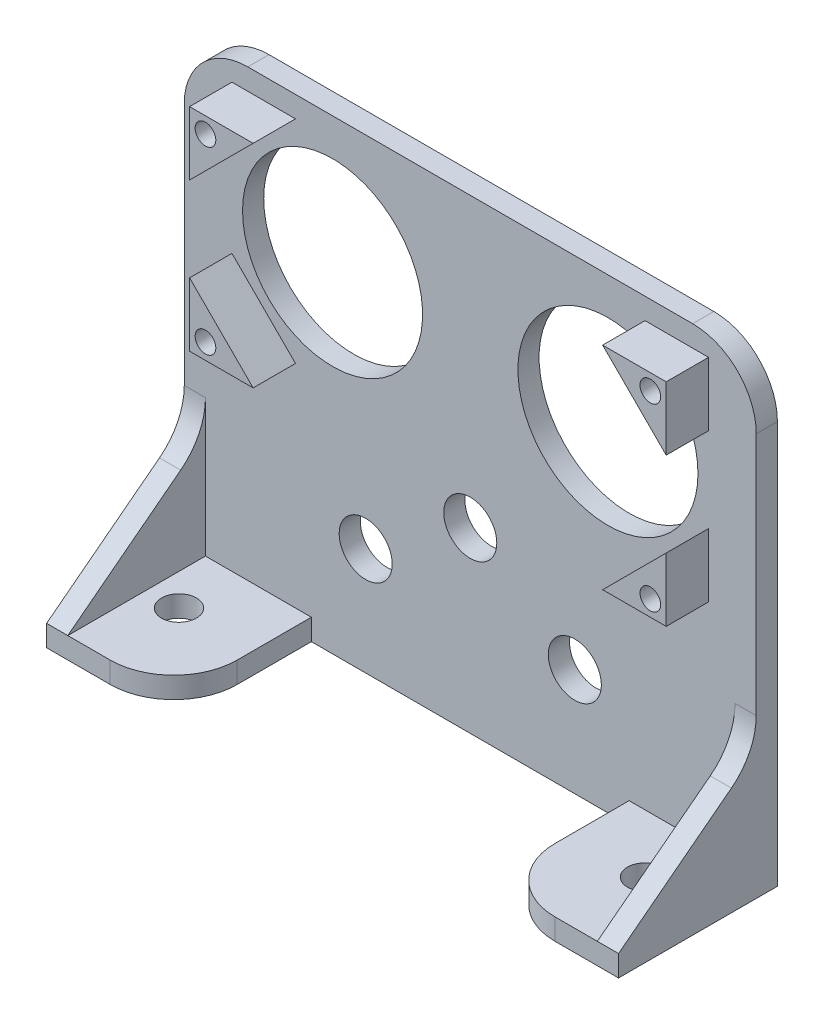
ISO-10303-21;
HEADER;
FILE_DESCRIPTION(('STEP AP214'),'2;1');
FILE_NAME('part.step','',(''),(''),'','','');
FILE_SCHEMA(('AUTOMOTIVE_DESIGN { 1 0 10303 214 1 1 1 1 }'));
ENDSEC;
DATA;
#1=APPLICATION_CONTEXT('core data for automotive mechanical design processes');
#2=APPLICATION_PROTOCOL_DEFINITION('international standard','automotive_design',2000,#1);
#3=PRODUCT_CONTEXT('',#1,'mechanical');
#4=PRODUCT('Part','Part','',(#3));
#5=PRODUCT_RELATED_PRODUCT_CATEGORY('part','',(#4));
#6=PRODUCT_DEFINITION_FORMATION('','',#4);
#7=PRODUCT_DEFINITION_CONTEXT('part definition',#1,'design');
#8=PRODUCT_DEFINITION('design','',#6,#7);
#9=PRODUCT_DEFINITION_SHAPE('','',#8);
#10=(LENGTH_UNIT() NAMED_UNIT(*) SI_UNIT(.MILLI.,.METRE.));
#11=(NAMED_UNIT(*) PLANE_ANGLE_UNIT() SI_UNIT($,.RADIAN.));
#12=(NAMED_UNIT(*) SI_UNIT($,.STERADIAN.) SOLID_ANGLE_UNIT());
#13=UNCERTAINTY_MEASURE_WITH_UNIT(LENGTH_MEASURE(1.E-05),#10,'distance_accuracy_value','');
#14=(GEOMETRIC_REPRESENTATION_CONTEXT(3) GLOBAL_UNCERTAINTY_ASSIGNED_CONTEXT((#13)) GLOBAL_UNIT_ASSIGNED_CONTEXT((#10,
#11,#12)) REPRESENTATION_CONTEXT('',''));
#15=CARTESIAN_POINT('',(0.,0.,0.));
#16=DIRECTION('',(0.,0.,1.));
#17=DIRECTION('',(1.,0.,0.));
#18=AXIS2_PLACEMENT_3D('',#15,#16,#17);
#19=CARTESIAN_POINT('',(0.,2.,0.));
#20=DIRECTION('',(0.,1.,0.));
#21=DIRECTION('',(0.,0.,1.));
#22=AXIS2_PLACEMENT_3D('',#19,#20,#21);
#23=PLANE('',#22);
#24=DIRECTION('',(0.,0.,-1.));
#25=VECTOR('',#24,1.);
#26=CARTESIAN_POINT('',(15.,2.,15.));
#27=LINE('',#26,#25);
#28=CARTESIAN_POINT('',(15.,2.,9.));
#29=VERTEX_POINT('',#28);
#30=CARTESIAN_POINT('',(15.,2.,1.99999999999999));
#31=VERTEX_POINT('',#30);
#32=EDGE_CURVE('E246',#29,#31,#27,.T.);
#33=ORIENTED_EDGE('',*,*,#32,.F.);
#34=CARTESIAN_POINT('',(21.,2.,9.));
#35=DIRECTION('',(0.,1.,0.));
#36=DIRECTION('',(0.,0.,1.));
#37=AXIS2_PLACEMENT_3D('',#34,#35,#36);
#38=CIRCLE('',#37,6.);
#39=CARTESIAN_POINT('',(21.,2.,15.));
#40=VERTEX_POINT('',#39);
#41=EDGE_CURVE('E392',#29,#40,#38,.T.);
#42=ORIENTED_EDGE('',*,*,#41,.T.);
#43=DIRECTION('',(-1.,0.,0.));
#44=VECTOR('',#43,1.);
#45=CARTESIAN_POINT('',(-27.,2.,15.));
#46=LINE('',#45,#44);
#47=CARTESIAN_POINT('',(25.,2.,15.));
#48=VERTEX_POINT('',#47);
#49=EDGE_CURVE('E552',#48,#40,#46,.T.);
#50=ORIENTED_EDGE('',*,*,#49,.F.);
#51=DIRECTION('',(0.,0.,-1.));
#52=VECTOR('',#51,1.);
#53=CARTESIAN_POINT('',(25.,2.,0.));
#54=LINE('',#53,#52);
#55=CARTESIAN_POINT('',(25.,2.,2.));
#56=VERTEX_POINT('',#55);
#57=EDGE_CURVE('E272',#48,#56,#54,.T.);
#58=ORIENTED_EDGE('',*,*,#57,.T.);
#59=DIRECTION('',(-1.,0.,0.));
#60=VECTOR('',#59,1.);
#61=CARTESIAN_POINT('',(0.,2.,2.));
#62=LINE('',#61,#60);
#63=EDGE_CURVE('E262',#56,#31,#62,.T.);
#64=ORIENTED_EDGE('',*,*,#63,.T.);
#65=EDGE_LOOP('',(#33,#42,#50,#58,#64));
#66=FACE_BOUND('',#65,.T.);
#67=CARTESIAN_POINT('',(22.,2.,7.5));
#68=DIRECTION('',(0.,-1.,0.));
#69=DIRECTION('',(0.,0.,-1.));
#70=AXIS2_PLACEMENT_3D('',#67,#68,#69);
#71=CIRCLE('',#70,1.65);
#72=CARTESIAN_POINT('',(22.,2.,5.85));
#73=VERTEX_POINT('',#72);
#74=EDGE_CURVE('E543',#73,#73,#71,.T.);
#75=ORIENTED_EDGE('',*,*,#74,.T.);
#76=EDGE_LOOP('',(#75));
#77=FACE_BOUND('',#76,.T.);
#78=ADVANCED_FACE('F43',(#66,#77),#23,.T.);
#79=CARTESIAN_POINT('',(-27.,2.,15.));
#80=DIRECTION('',(0.,0.,1.));
#81=DIRECTION('',(1.,0.,0.));
#82=AXIS2_PLACEMENT_3D('',#79,#80,#81);
#83=PLANE('',#82);
#84=ORIENTED_EDGE('',*,*,#49,.T.);
#85=DIRECTION('',(0.,1.,0.));
#86=VECTOR('',#85,1.);
#87=CARTESIAN_POINT('',(21.,0.,15.));
#88=LINE('',#87,#86);
#89=CARTESIAN_POINT('',(21.,0.,15.));
#90=VERTEX_POINT('',#89);
#91=EDGE_CURVE('E394',#40,#90,#88,.F.);
#92=ORIENTED_EDGE('',*,*,#91,.T.);
#93=DIRECTION('',(-1.,0.,0.));
#94=VECTOR('',#93,1.);
#95=CARTESIAN_POINT('',(-27.,0.,15.));
#96=LINE('',#95,#94);
#97=CARTESIAN_POINT('',(27.,0.,15.));
#98=VERTEX_POINT('',#97);
#99=EDGE_CURVE('E554',#98,#90,#96,.T.);
#100=ORIENTED_EDGE('',*,*,#99,.F.);
#101=DIRECTION('',(0.,-1.,0.));
#102=VECTOR('',#101,1.);
#103=CARTESIAN_POINT('',(27.,2.,15.));
#104=LINE('',#103,#102);
#105=CARTESIAN_POINT('',(27.,2.,15.));
#106=VERTEX_POINT('',#105);
#107=EDGE_CURVE('E282',#106,#98,#104,.T.);
#108=ORIENTED_EDGE('',*,*,#107,.F.);
#109=EDGE_CURVE('E549',#106,#48,#46,.T.);
#110=ORIENTED_EDGE('',*,*,#109,.T.);
#111=EDGE_LOOP('',(#84,#92,#100,#108,#110));
#112=FACE_BOUND('',#111,.T.);
#113=ADVANCED_FACE('F566',(#112),#83,.T.);
#114=CARTESIAN_POINT('',(0.,0.,2.));
#115=DIRECTION('',(0.,0.,1.));
#116=DIRECTION('',(1.,0.,0.));
#117=AXIS2_PLACEMENT_3D('',#114,#115,#116);
#118=PLANE('',#117);
#119=CARTESIAN_POINT('',(9.87338044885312,10.1480435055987,2.));
#120=DIRECTION('',(0.,0.,1.));
#121=DIRECTION('',(1.,0.,0.));
#122=AXIS2_PLACEMENT_3D('',#119,#120,#121);
#123=CIRCLE('',#122,2.505);
#124=CARTESIAN_POINT('',(12.3783804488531,10.1480435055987,2.));
#125=VERTEX_POINT('',#124);
#126=EDGE_CURVE('E287',#125,#125,#123,.T.);
#127=ORIENTED_EDGE('',*,*,#126,.F.);
#128=EDGE_LOOP('',(#127));
#129=FACE_BOUND('',#128,.T.);
#130=CARTESIAN_POINT('',(-13.,32.,2.));
#131=DIRECTION('',(0.,0.,1.));
#132=DIRECTION('',(-1.,0.,0.));
#133=AXIS2_PLACEMENT_3D('',#130,#131,#132);
#134=CIRCLE('',#133,8.5);
#135=CARTESIAN_POINT('',(-21.5,32.,2.));
#136=VERTEX_POINT('',#135);
#137=EDGE_CURVE('E299',#136,#136,#134,.T.);
#138=ORIENTED_EDGE('',*,*,#137,.F.);
#139=EDGE_LOOP('',(#138));
#140=FACE_BOUND('',#139,.T.);
#141=CARTESIAN_POINT('',(13.,32.,2.));
#142=DIRECTION('',(0.,0.,1.));
#143=DIRECTION('',(1.,0.,0.));
#144=AXIS2_PLACEMENT_3D('',#141,#142,#143);
#145=CIRCLE('',#144,8.5);
#146=CARTESIAN_POINT('',(21.5,32.,2.));
#147=VERTEX_POINT('',#146);
#148=EDGE_CURVE('E305',#147,#147,#145,.T.);
#149=ORIENTED_EDGE('',*,*,#148,.F.);
#150=EDGE_LOOP('',(#149));
#151=FACE_BOUND('',#150,.T.);
#152=CARTESIAN_POINT('',(0.,16.8131410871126,2.));
#153=DIRECTION('',(0.,0.,1.));
#154=DIRECTION('',(1.,0.,0.));
#155=AXIS2_PLACEMENT_3D('',#152,#153,#154);
#156=CIRCLE('',#155,2.505);
#157=CARTESIAN_POINT('',(2.505,16.8131410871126,2.));
#158=VERTEX_POINT('',#157);
#159=EDGE_CURVE('E293',#158,#158,#156,.T.);
#160=ORIENTED_EDGE('',*,*,#159,.F.);
#161=EDGE_LOOP('',(#160));
#162=FACE_BOUND('',#161,.T.);
#163=CARTESIAN_POINT('',(-9.87338044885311,10.1480435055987,2.));
#164=DIRECTION('',(0.,0.,1.));
#165=DIRECTION('',(-1.,0.,0.));
#166=AXIS2_PLACEMENT_3D('',#163,#164,#165);
#167=CIRCLE('',#166,2.505);
#168=CARTESIAN_POINT('',(-12.3783804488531,10.1480435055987,2.));
#169=VERTEX_POINT('',#168);
#170=EDGE_CURVE('E277',#169,#169,#167,.T.);
#171=ORIENTED_EDGE('',*,*,#170,.F.);
#172=EDGE_LOOP('',(#171));
#173=FACE_BOUND('',#172,.T.);
#174=DIRECTION('',(0.,1.,0.));
#175=VECTOR('',#174,1.);
#176=CARTESIAN_POINT('',(25.,0.,2.));
#177=LINE('',#176,#175);
#178=CARTESIAN_POINT('',(25.,14.954408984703,2.));
#179=VERTEX_POINT('',#178);
#180=EDGE_CURVE('E519',#56,#179,#177,.T.);
#181=ORIENTED_EDGE('',*,*,#180,.T.);
#182=DIRECTION('',(1.,0.,0.));
#183=VECTOR('',#182,1.);
#184=CARTESIAN_POINT('',(0.,14.954408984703,2.));
#185=LINE('',#184,#183);
#186=CARTESIAN_POINT('',(27.,14.954408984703,2.));
#187=VERTEX_POINT('',#186);
#188=EDGE_CURVE('E345',#179,#187,#185,.T.);
#189=ORIENTED_EDGE('',*,*,#188,.T.);
#190=DIRECTION('',(0.,1.,0.));
#191=VECTOR('',#190,1.);
#192=CARTESIAN_POINT('',(27.,0.,2.));
#193=LINE('',#192,#191);
#194=CARTESIAN_POINT('',(27.,38.,2.));
#195=VERTEX_POINT('',#194);
#196=EDGE_CURVE('E314',#187,#195,#193,.T.);
#197=ORIENTED_EDGE('',*,*,#196,.T.);
#198=CARTESIAN_POINT('',(21.,38.,2.));
#199=DIRECTION('',(0.,0.,1.));
#200=DIRECTION('',(1.,0.,0.));
#201=AXIS2_PLACEMENT_3D('',#198,#199,#200);
#202=CIRCLE('',#201,6.);
#203=CARTESIAN_POINT('',(21.,44.,2.));
#204=VERTEX_POINT('',#203);
#205=EDGE_CURVE('E340',#195,#204,#202,.T.);
#206=ORIENTED_EDGE('',*,*,#205,.T.);
#207=DIRECTION('',(-1.,0.,0.));
#208=VECTOR('',#207,1.);
#209=CARTESIAN_POINT('',(27.,44.,2.));
#210=LINE('',#209,#208);
#211=CARTESIAN_POINT('',(-21.,44.,2.));
#212=VERTEX_POINT('',#211);
#213=EDGE_CURVE('E318',#204,#212,#210,.T.);
#214=ORIENTED_EDGE('',*,*,#213,.T.);
#215=CARTESIAN_POINT('',(-21.,38.,2.));
#216=DIRECTION('',(0.,0.,1.));
#217=DIRECTION('',(1.,0.,0.));
#218=AXIS2_PLACEMENT_3D('',#215,#216,#217);
#219=CIRCLE('',#218,6.);
#220=CARTESIAN_POINT('',(-27.,38.,2.));
#221=VERTEX_POINT('',#220);
#222=EDGE_CURVE('E338',#212,#221,#219,.T.);
#223=ORIENTED_EDGE('',*,*,#222,.T.);
#224=DIRECTION('',(0.,-1.,0.));
#225=VECTOR('',#224,1.);
#226=CARTESIAN_POINT('',(-27.,0.,2.));
#227=LINE('',#226,#225);
#228=CARTESIAN_POINT('',(-27.,14.954408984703,2.));
#229=VERTEX_POINT('',#228);
#230=EDGE_CURVE('E311',#221,#229,#227,.T.);
#231=ORIENTED_EDGE('',*,*,#230,.T.);
#232=DIRECTION('',(-1.,0.,0.));
#233=VECTOR('',#232,1.);
#234=CARTESIAN_POINT('',(-25.,14.954408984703,2.));
#235=LINE('',#234,#233);
#236=CARTESIAN_POINT('',(-25.,14.954408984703,2.));
#237=VERTEX_POINT('',#236);
#238=EDGE_CURVE('E342',#229,#237,#235,.F.);
#239=ORIENTED_EDGE('',*,*,#238,.T.);
#240=DIRECTION('',(0.,-1.,0.));
#241=VECTOR('',#240,1.);
#242=CARTESIAN_POINT('',(-25.,0.,2.));
#243=LINE('',#242,#241);
#244=CARTESIAN_POINT('',(-25.,2.,2.));
#245=VERTEX_POINT('',#244);
#246=EDGE_CURVE('E533',#237,#245,#243,.T.);
#247=ORIENTED_EDGE('',*,*,#246,.T.);
#248=CARTESIAN_POINT('',(-15.,2.,2.));
#249=VERTEX_POINT('',#248);
#250=EDGE_CURVE('E274',#249,#245,#62,.T.);
#251=ORIENTED_EDGE('',*,*,#250,.F.);
#252=DIRECTION('',(0.,1.,0.));
#253=VECTOR('',#252,1.);
#254=CARTESIAN_POINT('',(-15.,-8.,2.));
#255=LINE('',#254,#253);
#256=CARTESIAN_POINT('',(-15.,0.,2.));
#257=VERTEX_POINT('',#256);
#258=EDGE_CURVE('E266',#257,#249,#255,.T.);
#259=ORIENTED_EDGE('',*,*,#258,.F.);
#260=DIRECTION('',(-1.,0.,0.));
#261=VECTOR('',#260,1.);
#262=CARTESIAN_POINT('',(-27.,0.,2.));
#263=LINE('',#262,#261);
#264=CARTESIAN_POINT('',(15.,0.,1.99999999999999));
#265=VERTEX_POINT('',#264);
#266=EDGE_CURVE('E265',#265,#257,#263,.T.);
#267=ORIENTED_EDGE('',*,*,#266,.F.);
#268=DIRECTION('',(0.,1.,0.));
#269=VECTOR('',#268,1.);
#270=CARTESIAN_POINT('',(15.,-8.,1.99999999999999));
#271=LINE('',#270,#269);
#272=EDGE_CURVE('E250',#265,#31,#271,.T.);
#273=ORIENTED_EDGE('',*,*,#272,.T.);
#274=ORIENTED_EDGE('',*,*,#63,.F.);
#275=EDGE_LOOP('',(#181,#189,#197,#206,#214,#223,#231,#239,#247,#251,#259,#267,#273,#274));
#276=FACE_BOUND('',#275,.T.);
#277=DIRECTION('',(-0.707106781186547,-0.707106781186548,0.));
#278=VECTOR('',#277,1.);
#279=CARTESIAN_POINT('',(22.5,28.,2.));
#280=LINE('',#279,#278);
#281=CARTESIAN_POINT('',(22.5,28.,2.));
#282=VERTEX_POINT('',#281);
#283=CARTESIAN_POINT('',(16.5,22.,2.));
#284=VERTEX_POINT('',#283);
#285=EDGE_CURVE('E505',#282,#284,#280,.T.);
#286=ORIENTED_EDGE('',*,*,#285,.F.);
#287=DIRECTION('',(0.,1.,0.));
#288=VECTOR('',#287,1.);
#289=CARTESIAN_POINT('',(22.5,28.,2.));
#290=LINE('',#289,#288);
#291=CARTESIAN_POINT('',(22.5,22.,2.));
#292=VERTEX_POINT('',#291);
#293=EDGE_CURVE('E493',#292,#282,#290,.T.);
#294=ORIENTED_EDGE('',*,*,#293,.F.);
#295=DIRECTION('',(1.,0.,0.));
#296=VECTOR('',#295,1.);
#297=CARTESIAN_POINT('',(16.5,22.,2.));
#298=LINE('',#297,#296);
#299=EDGE_CURVE('E498',#284,#292,#298,.T.);
#300=ORIENTED_EDGE('',*,*,#299,.F.);
#301=EDGE_LOOP('',(#286,#294,#300));
#302=FACE_BOUND('',#301,.T.);
#303=DIRECTION('',(0.707106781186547,0.707106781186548,0.));
#304=VECTOR('',#303,1.);
#305=CARTESIAN_POINT('',(-22.5,36.,2.));
#306=LINE('',#305,#304);
#307=CARTESIAN_POINT('',(-22.5,36.,2.));
#308=VERTEX_POINT('',#307);
#309=CARTESIAN_POINT('',(-16.5,42.,2.));
#310=VERTEX_POINT('',#309);
#311=EDGE_CURVE('E483',#308,#310,#306,.T.);
#312=ORIENTED_EDGE('',*,*,#311,.F.);
#313=DIRECTION('',(0.,-1.,0.));
#314=VECTOR('',#313,1.);
#315=CARTESIAN_POINT('',(-22.5,42.,2.));
#316=LINE('',#315,#314);
#317=CARTESIAN_POINT('',(-22.5,42.,2.));
#318=VERTEX_POINT('',#317);
#319=EDGE_CURVE('E471',#318,#308,#316,.T.);
#320=ORIENTED_EDGE('',*,*,#319,.F.);
#321=DIRECTION('',(-1.,0.,0.));
#322=VECTOR('',#321,1.);
#323=CARTESIAN_POINT('',(-22.5,42.,2.));
#324=LINE('',#323,#322);
#325=EDGE_CURVE('E476',#310,#318,#324,.T.);
#326=ORIENTED_EDGE('',*,*,#325,.F.);
#327=EDGE_LOOP('',(#312,#320,#326));
#328=FACE_BOUND('',#327,.T.);
#329=DIRECTION('',(1.,0.,0.));
#330=VECTOR('',#329,1.);
#331=CARTESIAN_POINT('',(-22.5,22.,2.));
#332=LINE('',#331,#330);
#333=CARTESIAN_POINT('',(-22.5,22.,2.));
#334=VERTEX_POINT('',#333);
#335=CARTESIAN_POINT('',(-16.5,22.,2.));
#336=VERTEX_POINT('',#335);
#337=EDGE_CURVE('E461',#334,#336,#332,.T.);
#338=ORIENTED_EDGE('',*,*,#337,.F.);
#339=DIRECTION('',(0.,-1.,0.));
#340=VECTOR('',#339,1.);
#341=CARTESIAN_POINT('',(-22.5,28.,2.));
#342=LINE('',#341,#340);
#343=CARTESIAN_POINT('',(-22.5,28.,2.));
#344=VERTEX_POINT('',#343);
#345=EDGE_CURVE('E449',#344,#334,#342,.T.);
#346=ORIENTED_EDGE('',*,*,#345,.F.);
#347=DIRECTION('',(-0.707106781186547,0.707106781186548,0.));
#348=VECTOR('',#347,1.);
#349=CARTESIAN_POINT('',(-22.5,28.,2.));
#350=LINE('',#349,#348);
#351=EDGE_CURVE('E454',#336,#344,#350,.T.);
#352=ORIENTED_EDGE('',*,*,#351,.F.);
#353=EDGE_LOOP('',(#338,#346,#352));
#354=FACE_BOUND('',#353,.T.);
#355=DIRECTION('',(0.707106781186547,-0.707106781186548,0.));
#356=VECTOR('',#355,1.);
#357=CARTESIAN_POINT('',(22.5,36.,2.));
#358=LINE('',#357,#356);
#359=CARTESIAN_POINT('',(16.5,42.,2.));
#360=VERTEX_POINT('',#359);
#361=CARTESIAN_POINT('',(22.5,36.,2.));
#362=VERTEX_POINT('',#361);
#363=EDGE_CURVE('E439',#360,#362,#358,.T.);
#364=ORIENTED_EDGE('',*,*,#363,.F.);
#365=DIRECTION('',(-1.,0.,0.));
#366=VECTOR('',#365,1.);
#367=CARTESIAN_POINT('',(16.5,42.,2.));
#368=LINE('',#367,#366);
#369=CARTESIAN_POINT('',(22.5,42.,2.));
#370=VERTEX_POINT('',#369);
#371=EDGE_CURVE('E389',#370,#360,#368,.T.);
#372=ORIENTED_EDGE('',*,*,#371,.F.);
#373=DIRECTION('',(0.,1.,0.));
#374=VECTOR('',#373,1.);
#375=CARTESIAN_POINT('',(22.5,42.,2.));
#376=LINE('',#375,#374);
#377=EDGE_CURVE('E432',#362,#370,#376,.T.);
#378=ORIENTED_EDGE('',*,*,#377,.F.);
#379=EDGE_LOOP('',(#364,#372,#378));
#380=FACE_BOUND('',#379,.T.);
#381=ADVANCED_FACE('F260',(#129,#140,#151,#162,#173,#276,#302,#328,#354,#380),#118,.T.);
#382=CARTESIAN_POINT('',(-21.,2.,15.));
#383=VERTEX_POINT('',#382);
#384=CARTESIAN_POINT('',(-25.,2.,15.));
#385=VERTEX_POINT('',#384);
#386=EDGE_CURVE('E553',#383,#385,#46,.T.);
#387=ORIENTED_EDGE('',*,*,#386,.F.);
#388=CARTESIAN_POINT('',(-21.,2.,9.));
#389=DIRECTION('',(0.,1.,0.));
#390=DIRECTION('',(0.,0.,1.));
#391=AXIS2_PLACEMENT_3D('',#388,#389,#390);
#392=CIRCLE('',#391,6.);
#393=CARTESIAN_POINT('',(-15.,2.,9.));
#394=VERTEX_POINT('',#393);
#395=EDGE_CURVE('E11',#383,#394,#392,.T.);
#396=ORIENTED_EDGE('',*,*,#395,.T.);
#397=DIRECTION('',(0.,0.,1.));
#398=VECTOR('',#397,1.);
#399=CARTESIAN_POINT('',(-15.,2.,15.));
#400=LINE('',#399,#398);
#401=EDGE_CURVE('E255',#249,#394,#400,.T.);
#402=ORIENTED_EDGE('',*,*,#401,.F.);
#403=ORIENTED_EDGE('',*,*,#250,.T.);
#404=DIRECTION('',(0.,0.,1.));
#405=VECTOR('',#404,1.);
#406=CARTESIAN_POINT('',(-25.,2.,0.));
#407=LINE('',#406,#405);
#408=EDGE_CURVE('E335',#245,#385,#407,.T.);
#409=ORIENTED_EDGE('',*,*,#408,.T.);
#410=EDGE_LOOP('',(#387,#396,#402,#403,#409));
#411=FACE_BOUND('',#410,.T.);
#412=CARTESIAN_POINT('',(-22.,2.,7.5));
#413=DIRECTION('',(0.,-1.,0.));
#414=DIRECTION('',(0.,0.,1.));
#415=AXIS2_PLACEMENT_3D('',#412,#413,#414);
#416=CIRCLE('',#415,1.65);
#417=CARTESIAN_POINT('',(-22.,2.,9.15));
#418=VERTEX_POINT('',#417);
#419=EDGE_CURVE('E537',#418,#418,#416,.T.);
#420=ORIENTED_EDGE('',*,*,#419,.T.);
#421=EDGE_LOOP('',(#420));
#422=FACE_BOUND('',#421,.T.);
#423=ADVANCED_FACE('F581',(#411,#422),#23,.T.);
#424=CARTESIAN_POINT('',(0.,0.,0.));
#425=DIRECTION('',(0.,0.,1.));
#426=DIRECTION('',(1.,0.,0.));
#427=AXIS2_PLACEMENT_3D('',#424,#425,#426);
#428=PLANE('',#427);
#429=CARTESIAN_POINT('',(-21.,23.5,0.));
#430=DIRECTION('',(0.,0.,1.));
#431=DIRECTION('',(1.,0.,0.));
#432=AXIS2_PLACEMENT_3D('',#429,#430,#431);
#433=CIRCLE('',#432,0.975);
#434=CARTESIAN_POINT('',(-20.025,23.5,0.));
#435=VERTEX_POINT('',#434);
#436=EDGE_CURVE('E414',#435,#435,#433,.T.);
#437=ORIENTED_EDGE('',*,*,#436,.T.);
#438=EDGE_LOOP('',(#437));
#439=FACE_BOUND('',#438,.T.);
#440=CARTESIAN_POINT('',(-21.,40.5,0.));
#441=DIRECTION('',(0.,0.,1.));
#442=DIRECTION('',(1.,0.,0.));
#443=AXIS2_PLACEMENT_3D('',#440,#441,#442);
#444=CIRCLE('',#443,0.975000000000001);
#445=CARTESIAN_POINT('',(-20.025,40.5,0.));
#446=VERTEX_POINT('',#445);
#447=EDGE_CURVE('E421',#446,#446,#444,.T.);
#448=ORIENTED_EDGE('',*,*,#447,.T.);
#449=EDGE_LOOP('',(#448));
#450=FACE_BOUND('',#449,.T.);
#451=CARTESIAN_POINT('',(21.,40.5,0.));
#452=DIRECTION('',(0.,0.,1.));
#453=DIRECTION('',(1.,0.,0.));
#454=AXIS2_PLACEMENT_3D('',#451,#452,#453);
#455=CIRCLE('',#454,0.974999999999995);
#456=CARTESIAN_POINT('',(21.975,40.5,0.));
#457=VERTEX_POINT('',#456);
#458=EDGE_CURVE('E418',#457,#457,#455,.T.);
#459=ORIENTED_EDGE('',*,*,#458,.T.);
#460=EDGE_LOOP('',(#459));
#461=FACE_BOUND('',#460,.T.);
#462=CARTESIAN_POINT('',(21.,23.5,0.));
#463=DIRECTION('',(0.,0.,1.));
#464=DIRECTION('',(1.,0.,0.));
#465=AXIS2_PLACEMENT_3D('',#462,#463,#464);
#466=CIRCLE('',#465,0.975);
#467=CARTESIAN_POINT('',(21.975,23.5,0.));
#468=VERTEX_POINT('',#467);
#469=EDGE_CURVE('E380',#468,#468,#466,.T.);
#470=ORIENTED_EDGE('',*,*,#469,.T.);
#471=EDGE_LOOP('',(#470));
#472=FACE_BOUND('',#471,.T.);
#473=DIRECTION('',(-1.,0.,0.));
#474=VECTOR('',#473,1.);
#475=CARTESIAN_POINT('',(27.,44.,0.));
#476=LINE('',#475,#474);
#477=CARTESIAN_POINT('',(21.,44.,0.));
#478=VERTEX_POINT('',#477);
#479=CARTESIAN_POINT('',(-21.,44.,0.));
#480=VERTEX_POINT('',#479);
#481=EDGE_CURVE('E315',#478,#480,#476,.T.);
#482=ORIENTED_EDGE('',*,*,#481,.F.);
#483=CARTESIAN_POINT('',(21.,38.,0.));
#484=DIRECTION('',(0.,0.,1.));
#485=DIRECTION('',(1.,0.,0.));
#486=AXIS2_PLACEMENT_3D('',#483,#484,#485);
#487=CIRCLE('',#486,6.);
#488=CARTESIAN_POINT('',(27.,38.,0.));
#489=VERTEX_POINT('',#488);
#490=EDGE_CURVE('E360',#478,#489,#487,.F.);
#491=ORIENTED_EDGE('',*,*,#490,.T.);
#492=DIRECTION('',(0.,1.,0.));
#493=VECTOR('',#492,1.);
#494=CARTESIAN_POINT('',(27.,0.,0.));
#495=LINE('',#494,#493);
#496=CARTESIAN_POINT('',(27.,0.,0.));
#497=VERTEX_POINT('',#496);
#498=EDGE_CURVE('E325',#497,#489,#495,.T.);
#499=ORIENTED_EDGE('',*,*,#498,.F.);
#500=DIRECTION('',(1.,0.,0.));
#501=VECTOR('',#500,1.);
#502=CARTESIAN_POINT('',(-27.,0.,0.));
#503=LINE('',#502,#501);
#504=CARTESIAN_POINT('',(-27.,0.,0.));
#505=VERTEX_POINT('',#504);
#506=EDGE_CURVE('E323',#505,#497,#503,.T.);
#507=ORIENTED_EDGE('',*,*,#506,.F.);
#508=DIRECTION('',(0.,-1.,0.));
#509=VECTOR('',#508,1.);
#510=CARTESIAN_POINT('',(-27.,0.,0.));
#511=LINE('',#510,#509);
#512=CARTESIAN_POINT('',(-27.,38.,0.));
#513=VERTEX_POINT('',#512);
#514=EDGE_CURVE('E308',#513,#505,#511,.T.);
#515=ORIENTED_EDGE('',*,*,#514,.F.);
#516=CARTESIAN_POINT('',(-21.,38.,0.));
#517=DIRECTION('',(0.,0.,1.));
#518=DIRECTION('',(1.,0.,0.));
#519=AXIS2_PLACEMENT_3D('',#516,#517,#518);
#520=CIRCLE('',#519,6.);
#521=EDGE_CURVE('E358',#513,#480,#520,.F.);
#522=ORIENTED_EDGE('',*,*,#521,.T.);
#523=EDGE_LOOP('',(#482,#491,#499,#507,#515,#522));
#524=FACE_BOUND('',#523,.T.);
#525=CARTESIAN_POINT('',(-9.87338044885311,10.1480435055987,0.));
#526=DIRECTION('',(0.,0.,1.));
#527=DIRECTION('',(-1.,0.,0.));
#528=AXIS2_PLACEMENT_3D('',#525,#526,#527);
#529=CIRCLE('',#528,2.505);
#530=CARTESIAN_POINT('',(-12.3783804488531,10.1480435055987,0.));
#531=VERTEX_POINT('',#530);
#532=EDGE_CURVE('E273',#531,#531,#529,.T.);
#533=ORIENTED_EDGE('',*,*,#532,.T.);
#534=EDGE_LOOP('',(#533));
#535=FACE_BOUND('',#534,.T.);
#536=CARTESIAN_POINT('',(9.87338044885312,10.1480435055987,0.));
#537=DIRECTION('',(0.,0.,1.));
#538=DIRECTION('',(1.,0.,0.));
#539=AXIS2_PLACEMENT_3D('',#536,#537,#538);
#540=CIRCLE('',#539,2.505);
#541=CARTESIAN_POINT('',(12.3783804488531,10.1480435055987,0.));
#542=VERTEX_POINT('',#541);
#543=EDGE_CURVE('E285',#542,#542,#540,.T.);
#544=ORIENTED_EDGE('',*,*,#543,.T.);
#545=EDGE_LOOP('',(#544));
#546=FACE_BOUND('',#545,.T.);
#547=CARTESIAN_POINT('',(0.,16.8131410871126,0.));
#548=DIRECTION('',(0.,0.,1.));
#549=DIRECTION('',(1.,0.,0.));
#550=AXIS2_PLACEMENT_3D('',#547,#548,#549);
#551=CIRCLE('',#550,2.505);
#552=CARTESIAN_POINT('',(2.505,16.8131410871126,0.));
#553=VERTEX_POINT('',#552);
#554=EDGE_CURVE('E290',#553,#553,#551,.T.);
#555=ORIENTED_EDGE('',*,*,#554,.T.);
#556=EDGE_LOOP('',(#555));
#557=FACE_BOUND('',#556,.T.);
#558=CARTESIAN_POINT('',(-13.,32.,0.));
#559=DIRECTION('',(0.,0.,1.));
#560=DIRECTION('',(-1.,0.,0.));
#561=AXIS2_PLACEMENT_3D('',#558,#559,#560);
#562=CIRCLE('',#561,8.5);
#563=CARTESIAN_POINT('',(-21.5,32.,0.));
#564=VERTEX_POINT('',#563);
#565=EDGE_CURVE('E296',#564,#564,#562,.T.);
#566=ORIENTED_EDGE('',*,*,#565,.T.);
#567=EDGE_LOOP('',(#566));
#568=FACE_BOUND('',#567,.T.);
#569=CARTESIAN_POINT('',(13.,32.,0.));
#570=DIRECTION('',(0.,0.,1.));
#571=DIRECTION('',(1.,0.,0.));
#572=AXIS2_PLACEMENT_3D('',#569,#570,#571);
#573=CIRCLE('',#572,8.5);
#574=CARTESIAN_POINT('',(21.5,32.,0.));
#575=VERTEX_POINT('',#574);
#576=EDGE_CURVE('E302',#575,#575,#573,.T.);
#577=ORIENTED_EDGE('',*,*,#576,.T.);
#578=EDGE_LOOP('',(#577));
#579=FACE_BOUND('',#578,.T.);
#580=ADVANCED_FACE('F605',(#439,#450,#461,#472,#524,#535,#546,#557,#568,#579),#428,.F.);
#581=CARTESIAN_POINT('',(-27.,0.,2.));
#582=DIRECTION('',(1.,0.,0.));
#583=DIRECTION('',(0.,0.,-1.));
#584=AXIS2_PLACEMENT_3D('',#581,#582,#583);
#585=PLANE('',#584);
#586=ORIENTED_EDGE('',*,*,#230,.F.);
#587=DIRECTION('',(0.,0.,-1.));
#588=VECTOR('',#587,1.);
#589=CARTESIAN_POINT('',(-27.,38.,2.));
#590=LINE('',#589,#588);
#591=EDGE_CURVE('E364',#221,#513,#590,.T.);
#592=ORIENTED_EDGE('',*,*,#591,.T.);
#593=ORIENTED_EDGE('',*,*,#514,.T.);
#594=DIRECTION('',(0.,0.,-1.));
#595=VECTOR('',#594,1.);
#596=CARTESIAN_POINT('',(-27.,0.,2.));
#597=LINE('',#596,#595);
#598=CARTESIAN_POINT('',(-27.,0.,15.));
#599=VERTEX_POINT('',#598);
#600=EDGE_CURVE('E332',#599,#505,#597,.T.);
#601=ORIENTED_EDGE('',*,*,#600,.F.);
#602=DIRECTION('',(0.,-1.,0.));
#603=VECTOR('',#602,1.);
#604=CARTESIAN_POINT('',(-27.,2.,15.));
#605=LINE('',#604,#603);
#606=CARTESIAN_POINT('',(-27.,2.,15.));
#607=VERTEX_POINT('',#606);
#608=EDGE_CURVE('E279',#607,#599,#605,.T.);
#609=ORIENTED_EDGE('',*,*,#608,.F.);
#610=DIRECTION('',(0.,0.609710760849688,-0.792623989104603));
#611=VECTOR('',#610,1.);
#612=CARTESIAN_POINT('',(-27.,2.,15.));
#613=LINE('',#612,#611);
#614=CARTESIAN_POINT('',(-27.,10.1986650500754,4.34173543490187));
#615=VERTEX_POINT('',#614);
#616=EDGE_CURVE('E524',#607,#615,#613,.T.);
#617=ORIENTED_EDGE('',*,*,#616,.T.);
#618=CARTESIAN_POINT('',(-27.,14.954408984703,8.));
#619=DIRECTION('',(1.,0.,0.));
#620=DIRECTION('',(0.,0.,-1.));
#621=AXIS2_PLACEMENT_3D('',#618,#619,#620);
#622=CIRCLE('',#621,6.);
#623=EDGE_CURVE('E372',#615,#229,#622,.T.);
#624=ORIENTED_EDGE('',*,*,#623,.T.);
#625=EDGE_LOOP('',(#586,#592,#593,#601,#609,#617,#624));
#626=FACE_BOUND('',#625,.T.);
#627=ADVANCED_FACE('F589',(#626),#585,.F.);
#628=CARTESIAN_POINT('',(-27.,0.,2.));
#629=DIRECTION('',(0.,1.,0.));
#630=DIRECTION('',(0.,0.,1.));
#631=AXIS2_PLACEMENT_3D('',#628,#629,#630);
#632=PLANE('',#631);
#633=ORIENTED_EDGE('',*,*,#99,.T.);
#634=CARTESIAN_POINT('',(21.,0.,9.));
#635=DIRECTION('',(0.,1.,0.));
#636=DIRECTION('',(0.,0.,1.));
#637=AXIS2_PLACEMENT_3D('',#634,#635,#636);
#638=CIRCLE('',#637,6.);
#639=CARTESIAN_POINT('',(15.,0.,9.));
#640=VERTEX_POINT('',#639);
#641=EDGE_CURVE('E398',#90,#640,#638,.F.);
#642=ORIENTED_EDGE('',*,*,#641,.T.);
#643=DIRECTION('',(0.,0.,-1.));
#644=VECTOR('',#643,1.);
#645=CARTESIAN_POINT('',(15.,0.,1.99999999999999));
#646=LINE('',#645,#644);
#647=EDGE_CURVE('E412',#640,#265,#646,.T.);
#648=ORIENTED_EDGE('',*,*,#647,.T.);
#649=ORIENTED_EDGE('',*,*,#266,.T.);
#650=DIRECTION('',(0.,0.,1.));
#651=VECTOR('',#650,1.);
#652=CARTESIAN_POINT('',(-15.,0.,2.));
#653=LINE('',#652,#651);
#654=CARTESIAN_POINT('',(-15.,0.,9.));
#655=VERTEX_POINT('',#654);
#656=EDGE_CURVE('E406',#257,#655,#653,.T.);
#657=ORIENTED_EDGE('',*,*,#656,.T.);
#658=CARTESIAN_POINT('',(-21.,0.,9.));
#659=DIRECTION('',(0.,1.,0.));
#660=DIRECTION('',(0.,0.,1.));
#661=AXIS2_PLACEMENT_3D('',#658,#659,#660);
#662=CIRCLE('',#661,6.);
#663=CARTESIAN_POINT('',(-21.,0.,15.));
#664=VERTEX_POINT('',#663);
#665=EDGE_CURVE('E396',#655,#664,#662,.F.);
#666=ORIENTED_EDGE('',*,*,#665,.T.);
#667=EDGE_CURVE('E546',#664,#599,#96,.T.);
#668=ORIENTED_EDGE('',*,*,#667,.T.);
#669=ORIENTED_EDGE('',*,*,#600,.T.);
#670=ORIENTED_EDGE('',*,*,#506,.T.);
#671=DIRECTION('',(0.,0.,-1.));
#672=VECTOR('',#671,1.);
#673=CARTESIAN_POINT('',(27.,0.,2.));
#674=LINE('',#673,#672);
#675=EDGE_CURVE('E321',#98,#497,#674,.T.);
#676=ORIENTED_EDGE('',*,*,#675,.F.);
#677=EDGE_LOOP('',(#633,#642,#648,#649,#657,#666,#668,#669,#670,#676));
#678=FACE_BOUND('',#677,.T.);
#679=CARTESIAN_POINT('',(-22.,0.,7.5));
#680=DIRECTION('',(0.,-1.,0.));
#681=DIRECTION('',(0.,0.,1.));
#682=AXIS2_PLACEMENT_3D('',#679,#680,#681);
#683=CIRCLE('',#682,1.65);
#684=CARTESIAN_POINT('',(-22.,0.,9.15));
#685=VERTEX_POINT('',#684);
#686=EDGE_CURVE('E536',#685,#685,#683,.T.);
#687=ORIENTED_EDGE('',*,*,#686,.F.);
#688=EDGE_LOOP('',(#687));
#689=FACE_BOUND('',#688,.T.);
#690=CARTESIAN_POINT('',(22.,0.,7.5));
#691=DIRECTION('',(0.,-1.,0.));
#692=DIRECTION('',(0.,0.,-1.));
#693=AXIS2_PLACEMENT_3D('',#690,#691,#692);
#694=CIRCLE('',#693,1.65);
#695=CARTESIAN_POINT('',(22.,0.,5.85));
#696=VERTEX_POINT('',#695);
#697=EDGE_CURVE('E540',#696,#696,#694,.T.);
#698=ORIENTED_EDGE('',*,*,#697,.F.);
#699=EDGE_LOOP('',(#698));
#700=FACE_BOUND('',#699,.T.);
#701=ADVANCED_FACE('F410',(#678,#689,#700),#632,.F.);
#702=CARTESIAN_POINT('',(27.,0.,2.));
#703=DIRECTION('',(-1.,0.,0.));
#704=DIRECTION('',(0.,0.,1.));
#705=AXIS2_PLACEMENT_3D('',#702,#703,#704);
#706=PLANE('',#705);
#707=ORIENTED_EDGE('',*,*,#498,.T.);
#708=DIRECTION('',(0.,0.,-1.));
#709=VECTOR('',#708,1.);
#710=CARTESIAN_POINT('',(27.,38.,2.));
#711=LINE('',#710,#709);
#712=EDGE_CURVE('E362',#489,#195,#711,.F.);
#713=ORIENTED_EDGE('',*,*,#712,.T.);
#714=ORIENTED_EDGE('',*,*,#196,.F.);
#715=CARTESIAN_POINT('',(27.,14.954408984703,8.));
#716=DIRECTION('',(-1.,0.,0.));
#717=DIRECTION('',(0.,0.,1.));
#718=AXIS2_PLACEMENT_3D('',#715,#716,#717);
#719=CIRCLE('',#718,6.);
#720=CARTESIAN_POINT('',(27.,10.1986650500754,4.34173543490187));
#721=VERTEX_POINT('',#720);
#722=EDGE_CURVE('E367',#187,#721,#719,.T.);
#723=ORIENTED_EDGE('',*,*,#722,.T.);
#724=DIRECTION('',(0.,0.609710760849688,-0.792623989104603));
#725=VECTOR('',#724,1.);
#726=CARTESIAN_POINT('',(27.,2.,15.));
#727=LINE('',#726,#725);
#728=EDGE_CURVE('E515',#106,#721,#727,.T.);
#729=ORIENTED_EDGE('',*,*,#728,.F.);
#730=ORIENTED_EDGE('',*,*,#107,.T.);
#731=ORIENTED_EDGE('',*,*,#675,.T.);
#732=EDGE_LOOP('',(#707,#713,#714,#723,#729,#730,#731));
#733=FACE_BOUND('',#732,.T.);
#734=ADVANCED_FACE('F561',(#733),#706,.F.);
#735=CARTESIAN_POINT('',(27.,44.,2.));
#736=DIRECTION('',(0.,-1.,0.));
#737=DIRECTION('',(1.,0.,0.));
#738=AXIS2_PLACEMENT_3D('',#735,#736,#737);
#739=PLANE('',#738);
#740=ORIENTED_EDGE('',*,*,#213,.F.);
#741=DIRECTION('',(0.,0.,-1.));
#742=VECTOR('',#741,1.);
#743=CARTESIAN_POINT('',(21.,44.,2.));
#744=LINE('',#743,#742);
#745=EDGE_CURVE('E355',#204,#478,#744,.T.);
#746=ORIENTED_EDGE('',*,*,#745,.T.);
#747=ORIENTED_EDGE('',*,*,#481,.T.);
#748=DIRECTION('',(0.,0.,-1.));
#749=VECTOR('',#748,1.);
#750=CARTESIAN_POINT('',(-21.,44.,2.));
#751=LINE('',#750,#749);
#752=EDGE_CURVE('E353',#480,#212,#751,.F.);
#753=ORIENTED_EDGE('',*,*,#752,.T.);
#754=EDGE_LOOP('',(#740,#746,#747,#753));
#755=FACE_BOUND('',#754,.T.);
#756=ADVANCED_FACE('F622',(#755),#739,.F.);
#757=CARTESIAN_POINT('',(13.,32.,2.));
#758=DIRECTION('',(0.,0.,-1.));
#759=DIRECTION('',(-1.,0.,0.));
#760=AXIS2_PLACEMENT_3D('',#757,#758,#759);
#761=CYLINDRICAL_SURFACE('',#760,8.5);
#762=ORIENTED_EDGE('',*,*,#148,.T.);
#763=EDGE_LOOP('',(#762));
#764=FACE_BOUND('',#763,.T.);
#765=ORIENTED_EDGE('',*,*,#576,.F.);
#766=EDGE_LOOP('',(#765));
#767=FACE_BOUND('',#766,.T.);
#768=ADVANCED_FACE('F619',(#764,#767),#761,.F.);
#769=CARTESIAN_POINT('',(-13.,32.,2.));
#770=DIRECTION('',(0.,0.,-1.));
#771=DIRECTION('',(-1.,0.,0.));
#772=AXIS2_PLACEMENT_3D('',#769,#770,#771);
#773=CYLINDRICAL_SURFACE('',#772,8.5);
#774=ORIENTED_EDGE('',*,*,#137,.T.);
#775=EDGE_LOOP('',(#774));
#776=FACE_BOUND('',#775,.T.);
#777=ORIENTED_EDGE('',*,*,#565,.F.);
#778=EDGE_LOOP('',(#777));
#779=FACE_BOUND('',#778,.T.);
#780=ADVANCED_FACE('F708',(#776,#779),#773,.F.);
#781=CARTESIAN_POINT('',(0.,16.8131410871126,2.));
#782=DIRECTION('',(0.,0.,-1.));
#783=DIRECTION('',(-1.,0.,0.));
#784=AXIS2_PLACEMENT_3D('',#781,#782,#783);
#785=CYLINDRICAL_SURFACE('',#784,2.505);
#786=ORIENTED_EDGE('',*,*,#159,.T.);
#787=EDGE_LOOP('',(#786));
#788=FACE_BOUND('',#787,.T.);
#789=ORIENTED_EDGE('',*,*,#554,.F.);
#790=EDGE_LOOP('',(#789));
#791=FACE_BOUND('',#790,.T.);
#792=ADVANCED_FACE('F705',(#788,#791),#785,.F.);
#793=CARTESIAN_POINT('',(9.87338044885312,10.1480435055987,2.));
#794=DIRECTION('',(0.,0.,-1.));
#795=DIRECTION('',(-1.,0.,0.));
#796=AXIS2_PLACEMENT_3D('',#793,#794,#795);
#797=CYLINDRICAL_SURFACE('',#796,2.505);
#798=ORIENTED_EDGE('',*,*,#126,.T.);
#799=EDGE_LOOP('',(#798));
#800=FACE_BOUND('',#799,.T.);
#801=ORIENTED_EDGE('',*,*,#543,.F.);
#802=EDGE_LOOP('',(#801));
#803=FACE_BOUND('',#802,.T.);
#804=ADVANCED_FACE('F699',(#800,#803),#797,.F.);
#805=CARTESIAN_POINT('',(-9.87338044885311,10.1480435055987,2.));
#806=DIRECTION('',(0.,0.,-1.));
#807=DIRECTION('',(-1.,0.,0.));
#808=AXIS2_PLACEMENT_3D('',#805,#806,#807);
#809=CYLINDRICAL_SURFACE('',#808,2.505);
#810=ORIENTED_EDGE('',*,*,#170,.T.);
#811=EDGE_LOOP('',(#810));
#812=FACE_BOUND('',#811,.T.);
#813=ORIENTED_EDGE('',*,*,#532,.F.);
#814=EDGE_LOOP('',(#813));
#815=FACE_BOUND('',#814,.T.);
#816=ADVANCED_FACE('F691',(#812,#815),#809,.F.);
#817=ORIENTED_EDGE('',*,*,#667,.F.);
#818=DIRECTION('',(0.,-1.,0.));
#819=VECTOR('',#818,1.);
#820=CARTESIAN_POINT('',(-21.,2.,15.));
#821=LINE('',#820,#819);
#822=EDGE_CURVE('E51',#664,#383,#821,.F.);
#823=ORIENTED_EDGE('',*,*,#822,.T.);
#824=ORIENTED_EDGE('',*,*,#386,.T.);
#825=DIRECTION('',(-1.,0.,0.));
#826=VECTOR('',#825,1.);
#827=CARTESIAN_POINT('',(-25.,2.,15.));
#828=LINE('',#827,#826);
#829=EDGE_CURVE('E528',#385,#607,#828,.T.);
#830=ORIENTED_EDGE('',*,*,#829,.T.);
#831=ORIENTED_EDGE('',*,*,#608,.T.);
#832=EDGE_LOOP('',(#817,#823,#824,#830,#831));
#833=FACE_BOUND('',#832,.T.);
#834=ADVANCED_FACE('F572',(#833),#83,.T.);
#835=CARTESIAN_POINT('',(22.,2.,7.5));
#836=DIRECTION('',(0.,-1.,0.));
#837=DIRECTION('',(0.,0.,-1.));
#838=AXIS2_PLACEMENT_3D('',#835,#836,#837);
#839=CYLINDRICAL_SURFACE('',#838,1.65);
#840=ORIENTED_EDGE('',*,*,#74,.F.);
#841=EDGE_LOOP('',(#840));
#842=FACE_BOUND('',#841,.T.);
#843=ORIENTED_EDGE('',*,*,#697,.T.);
#844=EDGE_LOOP('',(#843));
#845=FACE_BOUND('',#844,.T.);
#846=ADVANCED_FACE('F684',(#842,#845),#839,.F.);
#847=CARTESIAN_POINT('',(-22.,2.,7.5));
#848=DIRECTION('',(0.,-1.,0.));
#849=DIRECTION('',(0.,0.,-1.));
#850=AXIS2_PLACEMENT_3D('',#847,#848,#849);
#851=CYLINDRICAL_SURFACE('',#850,1.65);
#852=ORIENTED_EDGE('',*,*,#419,.F.);
#853=EDGE_LOOP('',(#852));
#854=FACE_BOUND('',#853,.T.);
#855=ORIENTED_EDGE('',*,*,#686,.T.);
#856=EDGE_LOOP('',(#855));
#857=FACE_BOUND('',#856,.T.);
#858=ADVANCED_FACE('F682',(#854,#857),#851,.F.);
#859=CARTESIAN_POINT('',(-25.,2.,15.));
#860=DIRECTION('',(0.,0.792623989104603,0.609710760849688));
#861=DIRECTION('',(0.,-0.609710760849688,0.792623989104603));
#862=AXIS2_PLACEMENT_3D('',#859,#860,#861);
#863=PLANE('',#862);
#864=DIRECTION('',(0.,0.609710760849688,-0.792623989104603));
#865=VECTOR('',#864,1.);
#866=CARTESIAN_POINT('',(-25.,2.,15.));
#867=LINE('',#866,#865);
#868=CARTESIAN_POINT('',(-25.,10.1986650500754,4.34173543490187));
#869=VERTEX_POINT('',#868);
#870=EDGE_CURVE('E525',#385,#869,#867,.T.);
#871=ORIENTED_EDGE('',*,*,#870,.T.);
#872=DIRECTION('',(-1.,0.,0.));
#873=VECTOR('',#872,1.);
#874=CARTESIAN_POINT('',(-27.,10.1986650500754,4.34173543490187));
#875=LINE('',#874,#873);
#876=EDGE_CURVE('E350',#869,#615,#875,.T.);
#877=ORIENTED_EDGE('',*,*,#876,.T.);
#878=ORIENTED_EDGE('',*,*,#616,.F.);
#879=ORIENTED_EDGE('',*,*,#829,.F.);
#880=EDGE_LOOP('',(#871,#877,#878,#879));
#881=FACE_BOUND('',#880,.T.);
#882=ADVANCED_FACE('F575',(#881),#863,.T.);
#883=CARTESIAN_POINT('',(-25.,0.,0.));
#884=DIRECTION('',(-1.,0.,0.));
#885=DIRECTION('',(0.,0.,1.));
#886=AXIS2_PLACEMENT_3D('',#883,#884,#885);
#887=PLANE('',#886);
#888=ORIENTED_EDGE('',*,*,#246,.F.);
#889=CARTESIAN_POINT('',(-25.,14.954408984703,8.));
#890=DIRECTION('',(-1.,0.,0.));
#891=DIRECTION('',(0.,0.,1.));
#892=AXIS2_PLACEMENT_3D('',#889,#890,#891);
#893=CIRCLE('',#892,6.);
#894=EDGE_CURVE('E374',#237,#869,#893,.T.);
#895=ORIENTED_EDGE('',*,*,#894,.T.);
#896=ORIENTED_EDGE('',*,*,#870,.F.);
#897=ORIENTED_EDGE('',*,*,#408,.F.);
#898=EDGE_LOOP('',(#888,#895,#896,#897));
#899=FACE_BOUND('',#898,.T.);
#900=ADVANCED_FACE('F579',(#899),#887,.F.);
#901=CARTESIAN_POINT('',(25.,2.,15.));
#902=DIRECTION('',(0.,-0.792623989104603,-0.609710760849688));
#903=DIRECTION('',(0.,0.609710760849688,-0.792623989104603));
#904=AXIS2_PLACEMENT_3D('',#901,#902,#903);
#905=PLANE('',#904);
#906=ORIENTED_EDGE('',*,*,#728,.T.);
#907=DIRECTION('',(1.,0.,0.));
#908=VECTOR('',#907,1.);
#909=CARTESIAN_POINT('',(25.,10.1986650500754,4.34173543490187));
#910=LINE('',#909,#908);
#911=CARTESIAN_POINT('',(25.,10.1986650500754,4.34173543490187));
#912=VERTEX_POINT('',#911);
#913=EDGE_CURVE('E348',#721,#912,#910,.F.);
#914=ORIENTED_EDGE('',*,*,#913,.T.);
#915=DIRECTION('',(0.,0.609710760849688,-0.792623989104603));
#916=VECTOR('',#915,1.);
#917=CARTESIAN_POINT('',(25.,2.,15.));
#918=LINE('',#917,#916);
#919=EDGE_CURVE('E516',#48,#912,#918,.T.);
#920=ORIENTED_EDGE('',*,*,#919,.F.);
#921=ORIENTED_EDGE('',*,*,#109,.F.);
#922=EDGE_LOOP('',(#906,#914,#920,#921));
#923=FACE_BOUND('',#922,.T.);
#924=ADVANCED_FACE('F667',(#923),#905,.F.);
#925=CARTESIAN_POINT('',(25.,0.,0.));
#926=DIRECTION('',(1.,0.,0.));
#927=DIRECTION('',(0.,0.,1.));
#928=AXIS2_PLACEMENT_3D('',#925,#926,#927);
#929=PLANE('',#928);
#930=ORIENTED_EDGE('',*,*,#57,.F.);
#931=ORIENTED_EDGE('',*,*,#919,.T.);
#932=CARTESIAN_POINT('',(25.,14.954408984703,8.));
#933=DIRECTION('',(1.,0.,0.));
#934=DIRECTION('',(0.,0.,-1.));
#935=AXIS2_PLACEMENT_3D('',#932,#933,#934);
#936=CIRCLE('',#935,6.);
#937=EDGE_CURVE('E369',#912,#179,#936,.T.);
#938=ORIENTED_EDGE('',*,*,#937,.T.);
#939=ORIENTED_EDGE('',*,*,#180,.F.);
#940=EDGE_LOOP('',(#930,#931,#938,#939));
#941=FACE_BOUND('',#940,.T.);
#942=ADVANCED_FACE('F635',(#941),#929,.F.);
#943=CARTESIAN_POINT('',(0.,14.954408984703,8.));
#944=DIRECTION('',(1.,0.,0.));
#945=DIRECTION('',(0.,0.,-1.));
#946=AXIS2_PLACEMENT_3D('',#943,#944,#945);
#947=CYLINDRICAL_SURFACE('',#946,6.);
#948=ORIENTED_EDGE('',*,*,#937,.F.);
#949=ORIENTED_EDGE('',*,*,#913,.F.);
#950=ORIENTED_EDGE('',*,*,#722,.F.);
#951=ORIENTED_EDGE('',*,*,#188,.F.);
#952=EDGE_LOOP('',(#948,#949,#950,#951));
#953=FACE_BOUND('',#952,.T.);
#954=ADVANCED_FACE('F632',(#953),#947,.F.);
#955=CARTESIAN_POINT('',(-25.,14.954408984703,8.));
#956=DIRECTION('',(1.,0.,0.));
#957=DIRECTION('',(0.,0.,-1.));
#958=AXIS2_PLACEMENT_3D('',#955,#956,#957);
#959=CYLINDRICAL_SURFACE('',#958,6.);
#960=ORIENTED_EDGE('',*,*,#894,.F.);
#961=ORIENTED_EDGE('',*,*,#238,.F.);
#962=ORIENTED_EDGE('',*,*,#623,.F.);
#963=ORIENTED_EDGE('',*,*,#876,.F.);
#964=EDGE_LOOP('',(#960,#961,#962,#963));
#965=FACE_BOUND('',#964,.T.);
#966=ADVANCED_FACE('F587',(#965),#959,.F.);
#967=CARTESIAN_POINT('',(21.,38.,2.));
#968=DIRECTION('',(0.,0.,-1.));
#969=DIRECTION('',(-1.,0.,0.));
#970=AXIS2_PLACEMENT_3D('',#967,#968,#969);
#971=CYLINDRICAL_SURFACE('',#970,6.);
#972=ORIENTED_EDGE('',*,*,#205,.F.);
#973=ORIENTED_EDGE('',*,*,#712,.F.);
#974=ORIENTED_EDGE('',*,*,#490,.F.);
#975=ORIENTED_EDGE('',*,*,#745,.F.);
#976=EDGE_LOOP('',(#972,#973,#974,#975));
#977=FACE_BOUND('',#976,.T.);
#978=ADVANCED_FACE('F639',(#977),#971,.T.);
#979=CARTESIAN_POINT('',(-21.,38.,2.));
#980=DIRECTION('',(0.,0.,-1.));
#981=DIRECTION('',(-1.,0.,0.));
#982=AXIS2_PLACEMENT_3D('',#979,#980,#981);
#983=CYLINDRICAL_SURFACE('',#982,6.);
#984=ORIENTED_EDGE('',*,*,#222,.F.);
#985=ORIENTED_EDGE('',*,*,#752,.F.);
#986=ORIENTED_EDGE('',*,*,#521,.F.);
#987=ORIENTED_EDGE('',*,*,#591,.F.);
#988=EDGE_LOOP('',(#984,#985,#986,#987));
#989=FACE_BOUND('',#988,.T.);
#990=ADVANCED_FACE('F642',(#989),#983,.T.);
#991=CARTESIAN_POINT('',(22.5,28.,6.));
#992=DIRECTION('',(-1.,0.,0.));
#993=DIRECTION('',(0.,-1.,0.));
#994=AXIS2_PLACEMENT_3D('',#991,#992,#993);
#995=PLANE('',#994);
#996=ORIENTED_EDGE('',*,*,#293,.T.);
#997=DIRECTION('',(0.,0.,-1.));
#998=VECTOR('',#997,1.);
#999=CARTESIAN_POINT('',(22.5,28.,6.));
#1000=LINE('',#999,#998);
#1001=CARTESIAN_POINT('',(22.5,28.,6.));
#1002=VERTEX_POINT('',#1001);
#1003=EDGE_CURVE('E513',#1002,#282,#1000,.T.);
#1004=ORIENTED_EDGE('',*,*,#1003,.F.);
#1005=DIRECTION('',(0.,1.,0.));
#1006=VECTOR('',#1005,1.);
#1007=CARTESIAN_POINT('',(22.5,28.,6.));
#1008=LINE('',#1007,#1006);
#1009=CARTESIAN_POINT('',(22.5,22.,6.));
#1010=VERTEX_POINT('',#1009);
#1011=EDGE_CURVE('E494',#1010,#1002,#1008,.T.);
#1012=ORIENTED_EDGE('',*,*,#1011,.F.);
#1013=DIRECTION('',(0.,0.,-1.));
#1014=VECTOR('',#1013,1.);
#1015=CARTESIAN_POINT('',(22.5,22.,6.));
#1016=LINE('',#1015,#1014);
#1017=EDGE_CURVE('E502',#1010,#292,#1016,.T.);
#1018=ORIENTED_EDGE('',*,*,#1017,.T.);
#1019=EDGE_LOOP('',(#996,#1004,#1012,#1018));
#1020=FACE_BOUND('',#1019,.T.);
#1021=ADVANCED_FACE('F645',(#1020),#995,.F.);
#1022=CARTESIAN_POINT('',(22.5,28.,6.));
#1023=DIRECTION('',(0.707106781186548,-0.707106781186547,0.));
#1024=DIRECTION('',(0.707106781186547,0.707106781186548,0.));
#1025=AXIS2_PLACEMENT_3D('',#1022,#1023,#1024);
#1026=PLANE('',#1025);
#1027=ORIENTED_EDGE('',*,*,#285,.T.);
#1028=DIRECTION('',(0.,0.,-1.));
#1029=VECTOR('',#1028,1.);
#1030=CARTESIAN_POINT('',(16.5,22.,6.));
#1031=LINE('',#1030,#1029);
#1032=CARTESIAN_POINT('',(16.5,22.,6.));
#1033=VERTEX_POINT('',#1032);
#1034=EDGE_CURVE('E511',#1033,#284,#1031,.T.);
#1035=ORIENTED_EDGE('',*,*,#1034,.F.);
#1036=DIRECTION('',(-0.707106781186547,-0.707106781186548,0.));
#1037=VECTOR('',#1036,1.);
#1038=CARTESIAN_POINT('',(22.5,28.,6.));
#1039=LINE('',#1038,#1037);
#1040=EDGE_CURVE('E497',#1002,#1033,#1039,.T.);
#1041=ORIENTED_EDGE('',*,*,#1040,.F.);
#1042=ORIENTED_EDGE('',*,*,#1003,.T.);
#1043=EDGE_LOOP('',(#1027,#1035,#1041,#1042));
#1044=FACE_BOUND('',#1043,.T.);
#1045=ADVANCED_FACE('F650',(#1044),#1026,.F.);
#1046=CARTESIAN_POINT('',(16.5,22.,6.));
#1047=DIRECTION('',(0.,1.,0.));
#1048=DIRECTION('',(-1.,0.,0.));
#1049=AXIS2_PLACEMENT_3D('',#1046,#1047,#1048);
#1050=PLANE('',#1049);
#1051=ORIENTED_EDGE('',*,*,#299,.T.);
#1052=ORIENTED_EDGE('',*,*,#1017,.F.);
#1053=DIRECTION('',(1.,0.,0.));
#1054=VECTOR('',#1053,1.);
#1055=CARTESIAN_POINT('',(16.5,22.,6.));
#1056=LINE('',#1055,#1054);
#1057=EDGE_CURVE('E500',#1033,#1010,#1056,.T.);
#1058=ORIENTED_EDGE('',*,*,#1057,.F.);
#1059=ORIENTED_EDGE('',*,*,#1034,.T.);
#1060=EDGE_LOOP('',(#1051,#1052,#1058,#1059));
#1061=FACE_BOUND('',#1060,.T.);
#1062=ADVANCED_FACE('F779',(#1061),#1050,.F.);
#1063=CARTESIAN_POINT('',(0.,0.,6.));
#1064=DIRECTION('',(0.,0.,1.));
#1065=DIRECTION('',(1.,0.,0.));
#1066=AXIS2_PLACEMENT_3D('',#1063,#1064,#1065);
#1067=PLANE('',#1066);
#1068=CARTESIAN_POINT('',(21.,23.5,6.));
#1069=DIRECTION('',(0.,0.,1.));
#1070=DIRECTION('',(1.,0.,0.));
#1071=AXIS2_PLACEMENT_3D('',#1068,#1069,#1070);
#1072=CIRCLE('',#1071,0.975);
#1073=CARTESIAN_POINT('',(21.975,23.5,6.));
#1074=VERTEX_POINT('',#1073);
#1075=EDGE_CURVE('E386',#1074,#1074,#1072,.T.);
#1076=ORIENTED_EDGE('',*,*,#1075,.F.);
#1077=EDGE_LOOP('',(#1076));
#1078=FACE_BOUND('',#1077,.T.);
#1079=ORIENTED_EDGE('',*,*,#1011,.T.);
#1080=ORIENTED_EDGE('',*,*,#1040,.T.);
#1081=ORIENTED_EDGE('',*,*,#1057,.T.);
#1082=EDGE_LOOP('',(#1079,#1080,#1081));
#1083=FACE_BOUND('',#1082,.T.);
#1084=ADVANCED_FACE('F773',(#1078,#1083),#1067,.T.);
#1085=CARTESIAN_POINT('',(-22.5,42.,6.));
#1086=DIRECTION('',(1.,0.,0.));
#1087=DIRECTION('',(0.,0.,-1.));
#1088=AXIS2_PLACEMENT_3D('',#1085,#1086,#1087);
#1089=PLANE('',#1088);
#1090=ORIENTED_EDGE('',*,*,#319,.T.);
#1091=DIRECTION('',(0.,0.,-1.));
#1092=VECTOR('',#1091,1.);
#1093=CARTESIAN_POINT('',(-22.5,36.,6.));
#1094=LINE('',#1093,#1092);
#1095=CARTESIAN_POINT('',(-22.5,36.,6.));
#1096=VERTEX_POINT('',#1095);
#1097=EDGE_CURVE('E491',#1096,#308,#1094,.T.);
#1098=ORIENTED_EDGE('',*,*,#1097,.F.);
#1099=DIRECTION('',(0.,-1.,0.));
#1100=VECTOR('',#1099,1.);
#1101=CARTESIAN_POINT('',(-22.5,42.,6.));
#1102=LINE('',#1101,#1100);
#1103=CARTESIAN_POINT('',(-22.5,42.,6.));
#1104=VERTEX_POINT('',#1103);
#1105=EDGE_CURVE('E472',#1104,#1096,#1102,.T.);
#1106=ORIENTED_EDGE('',*,*,#1105,.F.);
#1107=DIRECTION('',(0.,0.,-1.));
#1108=VECTOR('',#1107,1.);
#1109=CARTESIAN_POINT('',(-22.5,42.,6.));
#1110=LINE('',#1109,#1108);
#1111=EDGE_CURVE('E480',#1104,#318,#1110,.T.);
#1112=ORIENTED_EDGE('',*,*,#1111,.T.);
#1113=EDGE_LOOP('',(#1090,#1098,#1106,#1112));
#1114=FACE_BOUND('',#1113,.T.);
#1115=ADVANCED_FACE('F778',(#1114),#1089,.F.);
#1116=CARTESIAN_POINT('',(-22.5,36.,6.));
#1117=DIRECTION('',(-0.707106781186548,0.707106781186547,0.));
#1118=DIRECTION('',(-0.707106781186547,-0.707106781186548,0.));
#1119=AXIS2_PLACEMENT_3D('',#1116,#1117,#1118);
#1120=PLANE('',#1119);
#1121=ORIENTED_EDGE('',*,*,#311,.T.);
#1122=DIRECTION('',(0.,0.,-1.));
#1123=VECTOR('',#1122,1.);
#1124=CARTESIAN_POINT('',(-16.5,42.,6.));
#1125=LINE('',#1124,#1123);
#1126=CARTESIAN_POINT('',(-16.5,42.,6.));
#1127=VERTEX_POINT('',#1126);
#1128=EDGE_CURVE('E489',#1127,#310,#1125,.T.);
#1129=ORIENTED_EDGE('',*,*,#1128,.F.);
#1130=DIRECTION('',(0.707106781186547,0.707106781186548,0.));
#1131=VECTOR('',#1130,1.);
#1132=CARTESIAN_POINT('',(-22.5,36.,6.));
#1133=LINE('',#1132,#1131);
#1134=EDGE_CURVE('E475',#1096,#1127,#1133,.T.);
#1135=ORIENTED_EDGE('',*,*,#1134,.F.);
#1136=ORIENTED_EDGE('',*,*,#1097,.T.);
#1137=EDGE_LOOP('',(#1121,#1129,#1135,#1136));
#1138=FACE_BOUND('',#1137,.T.);
#1139=ADVANCED_FACE('F987',(#1138),#1120,.F.);
#1140=CARTESIAN_POINT('',(-22.5,42.,6.));
#1141=DIRECTION('',(0.,-1.,0.));
#1142=DIRECTION('',(0.,0.,-1.));
#1143=AXIS2_PLACEMENT_3D('',#1140,#1141,#1142);
#1144=PLANE('',#1143);
#1145=ORIENTED_EDGE('',*,*,#325,.T.);
#1146=ORIENTED_EDGE('',*,*,#1111,.F.);
#1147=DIRECTION('',(-1.,0.,0.));
#1148=VECTOR('',#1147,1.);
#1149=CARTESIAN_POINT('',(-22.5,42.,6.));
#1150=LINE('',#1149,#1148);
#1151=EDGE_CURVE('E478',#1127,#1104,#1150,.T.);
#1152=ORIENTED_EDGE('',*,*,#1151,.F.);
#1153=ORIENTED_EDGE('',*,*,#1128,.T.);
#1154=EDGE_LOOP('',(#1145,#1146,#1152,#1153));
#1155=FACE_BOUND('',#1154,.T.);
#1156=ADVANCED_FACE('F796',(#1155),#1144,.F.);
#1157=CARTESIAN_POINT('',(0.,0.,6.));
#1158=DIRECTION('',(0.,0.,1.));
#1159=DIRECTION('',(1.,0.,0.));
#1160=AXIS2_PLACEMENT_3D('',#1157,#1158,#1159);
#1161=PLANE('',#1160);
#1162=CARTESIAN_POINT('',(-21.,40.5,6.));
#1163=DIRECTION('',(0.,0.,1.));
#1164=DIRECTION('',(1.,0.,0.));
#1165=AXIS2_PLACEMENT_3D('',#1162,#1163,#1164);
#1166=CIRCLE('',#1165,0.975000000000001);
#1167=CARTESIAN_POINT('',(-20.025,40.5,6.));
#1168=VERTEX_POINT('',#1167);
#1169=EDGE_CURVE('E383',#1168,#1168,#1166,.T.);
#1170=ORIENTED_EDGE('',*,*,#1169,.F.);
#1171=EDGE_LOOP('',(#1170));
#1172=FACE_BOUND('',#1171,.T.);
#1173=ORIENTED_EDGE('',*,*,#1105,.T.);
#1174=ORIENTED_EDGE('',*,*,#1134,.T.);
#1175=ORIENTED_EDGE('',*,*,#1151,.T.);
#1176=EDGE_LOOP('',(#1173,#1174,#1175));
#1177=FACE_BOUND('',#1176,.T.);
#1178=ADVANCED_FACE('F790',(#1172,#1177),#1161,.T.);
#1179=CARTESIAN_POINT('',(-22.5,28.,6.));
#1180=DIRECTION('',(1.,0.,0.));
#1181=DIRECTION('',(0.,1.,0.));
#1182=AXIS2_PLACEMENT_3D('',#1179,#1180,#1181);
#1183=PLANE('',#1182);
#1184=ORIENTED_EDGE('',*,*,#345,.T.);
#1185=DIRECTION('',(0.,0.,-1.));
#1186=VECTOR('',#1185,1.);
#1187=CARTESIAN_POINT('',(-22.5,22.,6.));
#1188=LINE('',#1187,#1186);
#1189=CARTESIAN_POINT('',(-22.5,22.,6.));
#1190=VERTEX_POINT('',#1189);
#1191=EDGE_CURVE('E469',#1190,#334,#1188,.T.);
#1192=ORIENTED_EDGE('',*,*,#1191,.F.);
#1193=DIRECTION('',(0.,-1.,0.));
#1194=VECTOR('',#1193,1.);
#1195=CARTESIAN_POINT('',(-22.5,28.,6.));
#1196=LINE('',#1195,#1194);
#1197=CARTESIAN_POINT('',(-22.5,28.,6.));
#1198=VERTEX_POINT('',#1197);
#1199=EDGE_CURVE('E450',#1198,#1190,#1196,.T.);
#1200=ORIENTED_EDGE('',*,*,#1199,.F.);
#1201=DIRECTION('',(0.,0.,-1.));
#1202=VECTOR('',#1201,1.);
#1203=CARTESIAN_POINT('',(-22.5,28.,6.));
#1204=LINE('',#1203,#1202);
#1205=EDGE_CURVE('E458',#1198,#344,#1204,.T.);
#1206=ORIENTED_EDGE('',*,*,#1205,.T.);
#1207=EDGE_LOOP('',(#1184,#1192,#1200,#1206));
#1208=FACE_BOUND('',#1207,.T.);
#1209=ADVANCED_FACE('F795',(#1208),#1183,.F.);
#1210=CARTESIAN_POINT('',(-22.5,22.,6.));
#1211=DIRECTION('',(0.,1.,0.));
#1212=DIRECTION('',(-1.,0.,0.));
#1213=AXIS2_PLACEMENT_3D('',#1210,#1211,#1212);
#1214=PLANE('',#1213);
#1215=ORIENTED_EDGE('',*,*,#337,.T.);
#1216=DIRECTION('',(0.,0.,-1.));
#1217=VECTOR('',#1216,1.);
#1218=CARTESIAN_POINT('',(-16.5,22.,6.));
#1219=LINE('',#1218,#1217);
#1220=CARTESIAN_POINT('',(-16.5,22.,6.));
#1221=VERTEX_POINT('',#1220);
#1222=EDGE_CURVE('E467',#1221,#336,#1219,.T.);
#1223=ORIENTED_EDGE('',*,*,#1222,.F.);
#1224=DIRECTION('',(1.,0.,0.));
#1225=VECTOR('',#1224,1.);
#1226=CARTESIAN_POINT('',(-22.5,22.,6.));
#1227=LINE('',#1226,#1225);
#1228=EDGE_CURVE('E453',#1190,#1221,#1227,.T.);
#1229=ORIENTED_EDGE('',*,*,#1228,.F.);
#1230=ORIENTED_EDGE('',*,*,#1191,.T.);
#1231=EDGE_LOOP('',(#1215,#1223,#1229,#1230));
#1232=FACE_BOUND('',#1231,.T.);
#1233=ADVANCED_FACE('F1014',(#1232),#1214,.F.);
#1234=CARTESIAN_POINT('',(-22.5,28.,6.));
#1235=DIRECTION('',(-0.707106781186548,-0.707106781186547,0.));
#1236=DIRECTION('',(0.707106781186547,-0.707106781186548,0.));
#1237=AXIS2_PLACEMENT_3D('',#1234,#1235,#1236);
#1238=PLANE('',#1237);
#1239=ORIENTED_EDGE('',*,*,#351,.T.);
#1240=ORIENTED_EDGE('',*,*,#1205,.F.);
#1241=DIRECTION('',(-0.707106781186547,0.707106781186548,0.));
#1242=VECTOR('',#1241,1.);
#1243=CARTESIAN_POINT('',(-22.5,28.,6.));
#1244=LINE('',#1243,#1242);
#1245=EDGE_CURVE('E456',#1221,#1198,#1244,.T.);
#1246=ORIENTED_EDGE('',*,*,#1245,.F.);
#1247=ORIENTED_EDGE('',*,*,#1222,.T.);
#1248=EDGE_LOOP('',(#1239,#1240,#1246,#1247));
#1249=FACE_BOUND('',#1248,.T.);
#1250=ADVANCED_FACE('F813',(#1249),#1238,.F.);
#1251=CARTESIAN_POINT('',(0.,0.,6.));
#1252=DIRECTION('',(0.,0.,1.));
#1253=DIRECTION('',(1.,0.,0.));
#1254=AXIS2_PLACEMENT_3D('',#1251,#1252,#1253);
#1255=PLANE('',#1254);
#1256=CARTESIAN_POINT('',(-21.,23.5,6.));
#1257=DIRECTION('',(0.,0.,1.));
#1258=DIRECTION('',(1.,0.,0.));
#1259=AXIS2_PLACEMENT_3D('',#1256,#1257,#1258);
#1260=CIRCLE('',#1259,0.975);
#1261=CARTESIAN_POINT('',(-20.025,23.5,6.));
#1262=VERTEX_POINT('',#1261);
#1263=EDGE_CURVE('E379',#1262,#1262,#1260,.T.);
#1264=ORIENTED_EDGE('',*,*,#1263,.F.);
#1265=EDGE_LOOP('',(#1264));
#1266=FACE_BOUND('',#1265,.T.);
#1267=ORIENTED_EDGE('',*,*,#1199,.T.);
#1268=ORIENTED_EDGE('',*,*,#1228,.T.);
#1269=ORIENTED_EDGE('',*,*,#1245,.T.);
#1270=EDGE_LOOP('',(#1267,#1268,#1269));
#1271=FACE_BOUND('',#1270,.T.);
#1272=ADVANCED_FACE('F807',(#1266,#1271),#1255,.T.);
#1273=CARTESIAN_POINT('',(16.5,42.,6.));
#1274=DIRECTION('',(0.,-1.,0.));
#1275=DIRECTION('',(0.,0.,-1.));
#1276=AXIS2_PLACEMENT_3D('',#1273,#1274,#1275);
#1277=PLANE('',#1276);
#1278=ORIENTED_EDGE('',*,*,#371,.T.);
#1279=DIRECTION('',(0.,0.,-1.));
#1280=VECTOR('',#1279,1.);
#1281=CARTESIAN_POINT('',(16.5,42.,6.));
#1282=LINE('',#1281,#1280);
#1283=CARTESIAN_POINT('',(16.5,42.,6.));
#1284=VERTEX_POINT('',#1283);
#1285=EDGE_CURVE('E447',#1284,#360,#1282,.T.);
#1286=ORIENTED_EDGE('',*,*,#1285,.F.);
#1287=DIRECTION('',(-1.,0.,0.));
#1288=VECTOR('',#1287,1.);
#1289=CARTESIAN_POINT('',(16.5,42.,6.));
#1290=LINE('',#1289,#1288);
#1291=CARTESIAN_POINT('',(22.5,42.,6.));
#1292=VERTEX_POINT('',#1291);
#1293=EDGE_CURVE('E428',#1292,#1284,#1290,.T.);
#1294=ORIENTED_EDGE('',*,*,#1293,.F.);
#1295=DIRECTION('',(0.,0.,-1.));
#1296=VECTOR('',#1295,1.);
#1297=CARTESIAN_POINT('',(22.5,42.,6.));
#1298=LINE('',#1297,#1296);
#1299=EDGE_CURVE('E436',#1292,#370,#1298,.T.);
#1300=ORIENTED_EDGE('',*,*,#1299,.T.);
#1301=EDGE_LOOP('',(#1278,#1286,#1294,#1300));
#1302=FACE_BOUND('',#1301,.T.);
#1303=ADVANCED_FACE('F812',(#1302),#1277,.F.);
#1304=CARTESIAN_POINT('',(22.5,36.,6.));
#1305=DIRECTION('',(0.707106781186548,0.707106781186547,0.));
#1306=DIRECTION('',(-0.707106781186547,0.707106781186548,0.));
#1307=AXIS2_PLACEMENT_3D('',#1304,#1305,#1306);
#1308=PLANE('',#1307);
#1309=ORIENTED_EDGE('',*,*,#363,.T.);
#1310=DIRECTION('',(0.,0.,-1.));
#1311=VECTOR('',#1310,1.);
#1312=CARTESIAN_POINT('',(22.5,36.,6.));
#1313=LINE('',#1312,#1311);
#1314=CARTESIAN_POINT('',(22.5,36.,6.));
#1315=VERTEX_POINT('',#1314);
#1316=EDGE_CURVE('E445',#1315,#362,#1313,.T.);
#1317=ORIENTED_EDGE('',*,*,#1316,.F.);
#1318=DIRECTION('',(0.707106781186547,-0.707106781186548,0.));
#1319=VECTOR('',#1318,1.);
#1320=CARTESIAN_POINT('',(22.5,36.,6.));
#1321=LINE('',#1320,#1319);
#1322=EDGE_CURVE('E431',#1284,#1315,#1321,.T.);
#1323=ORIENTED_EDGE('',*,*,#1322,.F.);
#1324=ORIENTED_EDGE('',*,*,#1285,.T.);
#1325=EDGE_LOOP('',(#1309,#1317,#1323,#1324));
#1326=FACE_BOUND('',#1325,.T.);
#1327=ADVANCED_FACE('F1040',(#1326),#1308,.F.);
#1328=CARTESIAN_POINT('',(22.5,42.,6.));
#1329=DIRECTION('',(-1.,0.,0.));
#1330=DIRECTION('',(0.,-1.,0.));
#1331=AXIS2_PLACEMENT_3D('',#1328,#1329,#1330);
#1332=PLANE('',#1331);
#1333=ORIENTED_EDGE('',*,*,#377,.T.);
#1334=ORIENTED_EDGE('',*,*,#1299,.F.);
#1335=DIRECTION('',(0.,1.,0.));
#1336=VECTOR('',#1335,1.);
#1337=CARTESIAN_POINT('',(22.5,42.,6.));
#1338=LINE('',#1337,#1336);
#1339=EDGE_CURVE('E434',#1315,#1292,#1338,.T.);
#1340=ORIENTED_EDGE('',*,*,#1339,.F.);
#1341=ORIENTED_EDGE('',*,*,#1316,.T.);
#1342=EDGE_LOOP('',(#1333,#1334,#1340,#1341));
#1343=FACE_BOUND('',#1342,.T.);
#1344=ADVANCED_FACE('F768',(#1343),#1332,.F.);
#1345=CARTESIAN_POINT('',(0.,0.,6.));
#1346=DIRECTION('',(0.,0.,-1.));
#1347=DIRECTION('',(-1.,0.,0.));
#1348=AXIS2_PLACEMENT_3D('',#1345,#1346,#1347);
#1349=PLANE('',#1348);
#1350=CARTESIAN_POINT('',(21.,40.5,6.));
#1351=DIRECTION('',(0.,0.,-1.));
#1352=DIRECTION('',(-1.,0.,0.));
#1353=AXIS2_PLACEMENT_3D('',#1350,#1351,#1352);
#1354=CIRCLE('',#1353,0.974999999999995);
#1355=CARTESIAN_POINT('',(20.025,40.5,6.));
#1356=VERTEX_POINT('',#1355);
#1357=EDGE_CURVE('E376',#1356,#1356,#1354,.T.);
#1358=ORIENTED_EDGE('',*,*,#1357,.T.);
#1359=EDGE_LOOP('',(#1358));
#1360=FACE_BOUND('',#1359,.T.);
#1361=ORIENTED_EDGE('',*,*,#1293,.T.);
#1362=ORIENTED_EDGE('',*,*,#1322,.T.);
#1363=ORIENTED_EDGE('',*,*,#1339,.T.);
#1364=EDGE_LOOP('',(#1361,#1362,#1363));
#1365=FACE_BOUND('',#1364,.T.);
#1366=ADVANCED_FACE('F824',(#1360,#1365),#1349,.F.);
#1367=CARTESIAN_POINT('',(21.,40.5,0.));
#1368=DIRECTION('',(0.,0.,1.));
#1369=DIRECTION('',(1.,0.,0.));
#1370=AXIS2_PLACEMENT_3D('',#1367,#1368,#1369);
#1371=CYLINDRICAL_SURFACE('',#1370,0.974999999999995);
#1372=ORIENTED_EDGE('',*,*,#458,.F.);
#1373=EDGE_LOOP('',(#1372));
#1374=FACE_BOUND('',#1373,.T.);
#1375=ORIENTED_EDGE('',*,*,#1357,.F.);
#1376=EDGE_LOOP('',(#1375));
#1377=FACE_BOUND('',#1376,.T.);
#1378=ADVANCED_FACE('F829',(#1374,#1377),#1371,.F.);
#1379=CARTESIAN_POINT('',(-21.,23.5,0.));
#1380=DIRECTION('',(0.,0.,1.));
#1381=DIRECTION('',(1.,0.,0.));
#1382=AXIS2_PLACEMENT_3D('',#1379,#1380,#1381);
#1383=CYLINDRICAL_SURFACE('',#1382,0.975);
#1384=ORIENTED_EDGE('',*,*,#1263,.T.);
#1385=EDGE_LOOP('',(#1384));
#1386=FACE_BOUND('',#1385,.T.);
#1387=ORIENTED_EDGE('',*,*,#436,.F.);
#1388=EDGE_LOOP('',(#1387));
#1389=FACE_BOUND('',#1388,.T.);
#1390=ADVANCED_FACE('F840',(#1386,#1389),#1383,.F.);
#1391=CARTESIAN_POINT('',(-21.,40.5,0.));
#1392=DIRECTION('',(0.,0.,1.));
#1393=DIRECTION('',(1.,0.,0.));
#1394=AXIS2_PLACEMENT_3D('',#1391,#1392,#1393);
#1395=CYLINDRICAL_SURFACE('',#1394,0.975000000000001);
#1396=ORIENTED_EDGE('',*,*,#1169,.T.);
#1397=EDGE_LOOP('',(#1396));
#1398=FACE_BOUND('',#1397,.T.);
#1399=ORIENTED_EDGE('',*,*,#447,.F.);
#1400=EDGE_LOOP('',(#1399));
#1401=FACE_BOUND('',#1400,.T.);
#1402=ADVANCED_FACE('F851',(#1398,#1401),#1395,.F.);
#1403=CARTESIAN_POINT('',(21.,23.5,0.));
#1404=DIRECTION('',(0.,0.,1.));
#1405=DIRECTION('',(1.,0.,0.));
#1406=AXIS2_PLACEMENT_3D('',#1403,#1404,#1405);
#1407=CYLINDRICAL_SURFACE('',#1406,0.975);
#1408=ORIENTED_EDGE('',*,*,#1075,.T.);
#1409=EDGE_LOOP('',(#1408));
#1410=FACE_BOUND('',#1409,.T.);
#1411=ORIENTED_EDGE('',*,*,#469,.F.);
#1412=EDGE_LOOP('',(#1411));
#1413=FACE_BOUND('',#1412,.T.);
#1414=ADVANCED_FACE('F862',(#1410,#1413),#1407,.F.);
#1415=CARTESIAN_POINT('',(15.,-8.,15.));
#1416=DIRECTION('',(1.,0.,0.));
#1417=DIRECTION('',(0.,0.,-1.));
#1418=AXIS2_PLACEMENT_3D('',#1415,#1416,#1417);
#1419=PLANE('',#1418);
#1420=ORIENTED_EDGE('',*,*,#647,.F.);
#1421=DIRECTION('',(0.,1.,0.));
#1422=VECTOR('',#1421,1.);
#1423=CARTESIAN_POINT('',(15.,2.,9.));
#1424=LINE('',#1423,#1422);
#1425=EDGE_CURVE('E252',#640,#29,#1424,.T.);
#1426=ORIENTED_EDGE('',*,*,#1425,.T.);
#1427=ORIENTED_EDGE('',*,*,#32,.T.);
#1428=ORIENTED_EDGE('',*,*,#272,.F.);
#1429=EDGE_LOOP('',(#1420,#1426,#1427,#1428));
#1430=FACE_BOUND('',#1429,.T.);
#1431=ADVANCED_FACE('F249',(#1430),#1419,.F.);
#1432=CARTESIAN_POINT('',(-15.,-8.,15.));
#1433=DIRECTION('',(-1.,0.,0.));
#1434=DIRECTION('',(0.,0.,1.));
#1435=AXIS2_PLACEMENT_3D('',#1432,#1433,#1434);
#1436=PLANE('',#1435);
#1437=ORIENTED_EDGE('',*,*,#401,.T.);
#1438=DIRECTION('',(0.,-1.,0.));
#1439=VECTOR('',#1438,1.);
#1440=CARTESIAN_POINT('',(-15.,0.,9.));
#1441=LINE('',#1440,#1439);
#1442=EDGE_CURVE('E400',#394,#655,#1441,.T.);
#1443=ORIENTED_EDGE('',*,*,#1442,.T.);
#1444=ORIENTED_EDGE('',*,*,#656,.F.);
#1445=ORIENTED_EDGE('',*,*,#258,.T.);
#1446=EDGE_LOOP('',(#1437,#1443,#1444,#1445));
#1447=FACE_BOUND('',#1446,.T.);
#1448=ADVANCED_FACE('F405',(#1447),#1436,.F.);
#1449=CARTESIAN_POINT('',(21.,-8.,9.));
#1450=DIRECTION('',(0.,-1.,0.));
#1451=DIRECTION('',(0.,0.,-1.));
#1452=AXIS2_PLACEMENT_3D('',#1449,#1450,#1451);
#1453=CYLINDRICAL_SURFACE('',#1452,6.);
#1454=ORIENTED_EDGE('',*,*,#641,.F.);
#1455=ORIENTED_EDGE('',*,*,#91,.F.);
#1456=ORIENTED_EDGE('',*,*,#41,.F.);
#1457=ORIENTED_EDGE('',*,*,#1425,.F.);
#1458=EDGE_LOOP('',(#1454,#1455,#1456,#1457));
#1459=FACE_BOUND('',#1458,.T.);
#1460=ADVANCED_FACE('F570',(#1459),#1453,.T.);
#1461=CARTESIAN_POINT('',(-21.,-8.,9.));
#1462=DIRECTION('',(0.,1.,0.));
#1463=DIRECTION('',(0.,0.,1.));
#1464=AXIS2_PLACEMENT_3D('',#1461,#1462,#1463);
#1465=CYLINDRICAL_SURFACE('',#1464,6.);
#1466=ORIENTED_EDGE('',*,*,#395,.F.);
#1467=ORIENTED_EDGE('',*,*,#822,.F.);
#1468=ORIENTED_EDGE('',*,*,#665,.F.);
#1469=ORIENTED_EDGE('',*,*,#1442,.F.);
#1470=EDGE_LOOP('',(#1466,#1467,#1468,#1469));
#1471=FACE_BOUND('',#1470,.T.);
#1472=ADVANCED_FACE('F45',(#1471),#1465,.T.);
#1473=CLOSED_SHELL('',(#78,#113,#381,#423,#580,#627,#701,#734,#756,#768,#780,#792,#804,#816,
#834,#846,#858,#882,#900,#924,#942,#954,#966,#978,#990,#1021,#1045,#1062,#1084,#1115,#1139,
#1156,#1178,#1209,#1233,#1250,#1272,#1303,#1327,#1344,#1366,#1378,#1390,#1402,#1414,#1431,#1448,
#1460,#1472));
#1474=MANIFOLD_SOLID_BREP('B2',#1473);
#1475=ADVANCED_BREP_SHAPE_REPRESENTATION('',(#18,#1474),#14);
#1476=SHAPE_DEFINITION_REPRESENTATION(#9,#1475);
ENDSEC;
END-ISO-10303-21;
